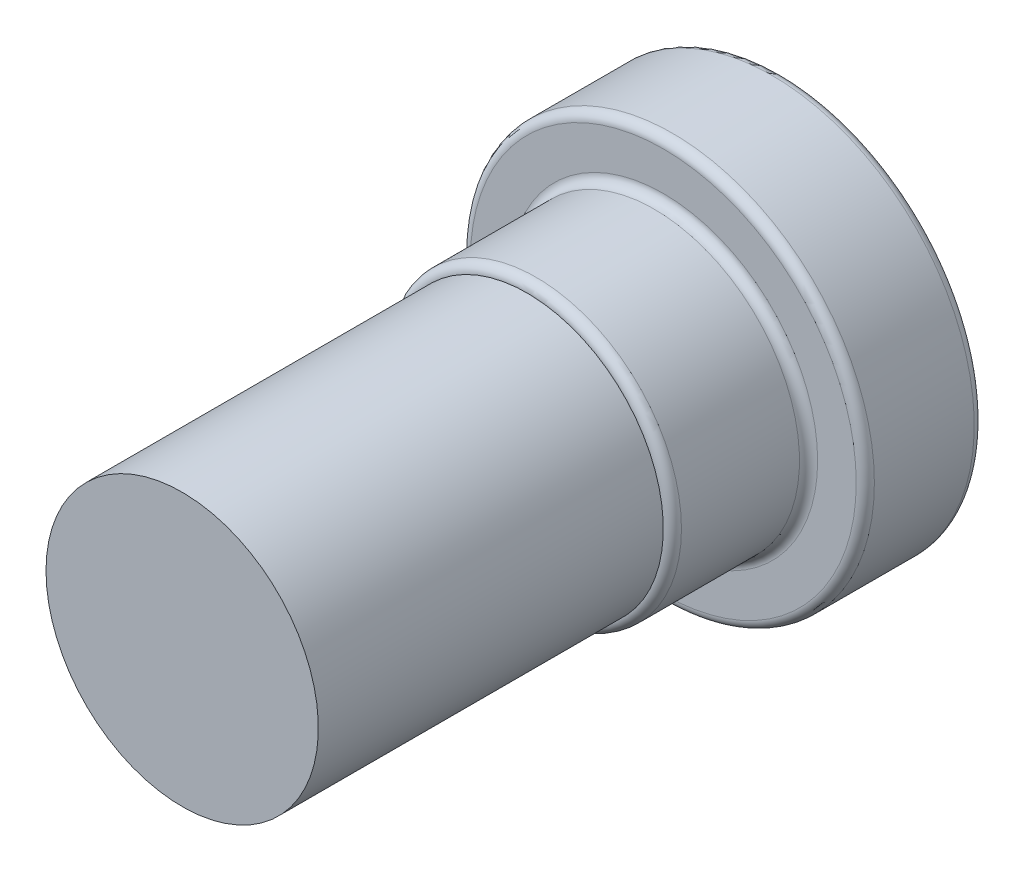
ISO-10303-21;
HEADER;
FILE_DESCRIPTION(('STEP AP214'),'2;1');
FILE_NAME('part.step','',(''),(''),'','','');
FILE_SCHEMA(('AUTOMOTIVE_DESIGN { 1 0 10303 214 1 1 1 1 }'));
ENDSEC;
DATA;
#1=APPLICATION_CONTEXT('core data for automotive mechanical design processes');
#2=APPLICATION_PROTOCOL_DEFINITION('international standard','automotive_design',2000,#1);
#3=PRODUCT_CONTEXT('',#1,'mechanical');
#4=PRODUCT('Part','Part','',(#3));
#5=PRODUCT_RELATED_PRODUCT_CATEGORY('part','',(#4));
#6=PRODUCT_DEFINITION_FORMATION('','',#4);
#7=PRODUCT_DEFINITION_CONTEXT('part definition',#1,'design');
#8=PRODUCT_DEFINITION('design','',#6,#7);
#9=PRODUCT_DEFINITION_SHAPE('','',#8);
#10=(LENGTH_UNIT() NAMED_UNIT(*) SI_UNIT(.MILLI.,.METRE.));
#11=(NAMED_UNIT(*) PLANE_ANGLE_UNIT() SI_UNIT($,.RADIAN.));
#12=(NAMED_UNIT(*) SI_UNIT($,.STERADIAN.) SOLID_ANGLE_UNIT());
#13=UNCERTAINTY_MEASURE_WITH_UNIT(LENGTH_MEASURE(1.E-05),#10,'distance_accuracy_value','');
#14=(GEOMETRIC_REPRESENTATION_CONTEXT(3) GLOBAL_UNCERTAINTY_ASSIGNED_CONTEXT((#13)) GLOBAL_UNIT_ASSIGNED_CONTEXT((#10,
#11,#12)) REPRESENTATION_CONTEXT('',''));
#15=CARTESIAN_POINT('',(0.,0.,0.));
#16=DIRECTION('',(0.,0.,1.));
#17=DIRECTION('',(1.,0.,0.));
#18=AXIS2_PLACEMENT_3D('',#15,#16,#17);
#19=CARTESIAN_POINT('',(0.,0.,1.5));
#20=DIRECTION('',(0.,0.,-1.));
#21=DIRECTION('',(-1.,0.,0.));
#22=AXIS2_PLACEMENT_3D('',#19,#20,#21);
#23=PLANE('',#22);
#24=DIRECTION('',(0.866025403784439,-0.5,0.));
#25=VECTOR('',#24,1.);
#26=CARTESIAN_POINT('',(0.,-1.15470053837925,1.5));
#27=LINE('',#26,#25);
#28=CARTESIAN_POINT('',(0.,-1.15470053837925,1.5));
#29=VERTEX_POINT('',#28);
#30=CARTESIAN_POINT('',(-1.,-0.577350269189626,1.5));
#31=VERTEX_POINT('',#30);
#32=EDGE_CURVE('E110',#29,#31,#27,.F.);
#33=ORIENTED_EDGE('',*,*,#32,.T.);
#34=DIRECTION('',(0.,-1.,0.));
#35=VECTOR('',#34,1.);
#36=CARTESIAN_POINT('',(-1.,-0.577350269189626,1.5));
#37=LINE('',#36,#35);
#38=CARTESIAN_POINT('',(-0.999999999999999,0.577350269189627,1.5));
#39=VERTEX_POINT('',#38);
#40=EDGE_CURVE('E430',#31,#39,#37,.F.);
#41=ORIENTED_EDGE('',*,*,#40,.T.);
#42=DIRECTION('',(-0.866025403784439,-0.5,0.));
#43=VECTOR('',#42,1.);
#44=CARTESIAN_POINT('',(-0.999999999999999,0.577350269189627,1.5));
#45=LINE('',#44,#43);
#46=CARTESIAN_POINT('',(0.,1.15470053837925,1.5));
#47=VERTEX_POINT('',#46);
#48=EDGE_CURVE('E437',#39,#47,#45,.F.);
#49=ORIENTED_EDGE('',*,*,#48,.T.);
#50=DIRECTION('',(-0.866025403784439,0.5,0.));
#51=VECTOR('',#50,1.);
#52=CARTESIAN_POINT('',(0.,1.15470053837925,1.5));
#53=LINE('',#52,#51);
#54=CARTESIAN_POINT('',(1.,0.577350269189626,1.5));
#55=VERTEX_POINT('',#54);
#56=EDGE_CURVE('E93',#47,#55,#53,.F.);
#57=ORIENTED_EDGE('',*,*,#56,.T.);
#58=DIRECTION('',(0.,1.,0.));
#59=VECTOR('',#58,1.);
#60=CARTESIAN_POINT('',(1.,0.577350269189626,1.5));
#61=LINE('',#60,#59);
#62=CARTESIAN_POINT('',(1.,-0.577350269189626,1.5));
#63=VERTEX_POINT('',#62);
#64=EDGE_CURVE('E90',#55,#63,#61,.F.);
#65=ORIENTED_EDGE('',*,*,#64,.T.);
#66=DIRECTION('',(0.866025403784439,0.5,0.));
#67=VECTOR('',#66,1.);
#68=CARTESIAN_POINT('',(1.,-0.577350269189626,1.5));
#69=LINE('',#68,#67);
#70=EDGE_CURVE('E87',#63,#29,#69,.F.);
#71=ORIENTED_EDGE('',*,*,#70,.T.);
#72=EDGE_LOOP('',(#33,#41,#49,#57,#65,#71));
#73=FACE_BOUND('',#72,.T.);
#74=ADVANCED_FACE('F17',(#73),#23,.T.);
#75=CARTESIAN_POINT('',(1.,0.577350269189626,1.5));
#76=DIRECTION('',(1.,0.,0.));
#77=DIRECTION('',(0.,1.,0.));
#78=AXIS2_PLACEMENT_3D('',#75,#76,#77);
#79=PLANE('',#78);
#80=DIRECTION('',(0.,0.,1.));
#81=VECTOR('',#80,1.);
#82=CARTESIAN_POINT('',(1.,-0.577350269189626,1.5));
#83=LINE('',#82,#81);
#84=CARTESIAN_POINT('',(1.,-0.577350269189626,0.));
#85=VERTEX_POINT('',#84);
#86=EDGE_CURVE('E96',#85,#63,#83,.T.);
#87=ORIENTED_EDGE('',*,*,#86,.T.);
#88=ORIENTED_EDGE('',*,*,#64,.F.);
#89=DIRECTION('',(0.,0.,1.));
#90=VECTOR('',#89,1.);
#91=CARTESIAN_POINT('',(1.,0.577350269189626,1.5));
#92=LINE('',#91,#90);
#93=CARTESIAN_POINT('',(1.,0.577350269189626,0.));
#94=VERTEX_POINT('',#93);
#95=EDGE_CURVE('E445',#55,#94,#92,.F.);
#96=ORIENTED_EDGE('',*,*,#95,.T.);
#97=DIRECTION('',(0.,1.,0.));
#98=VECTOR('',#97,1.);
#99=CARTESIAN_POINT('',(1.,0.,0.));
#100=LINE('',#99,#98);
#101=EDGE_CURVE('E101',#94,#85,#100,.F.);
#102=ORIENTED_EDGE('',*,*,#101,.T.);
#103=EDGE_LOOP('',(#87,#88,#96,#102));
#104=FACE_BOUND('',#103,.T.);
#105=ADVANCED_FACE('F99',(#104),#79,.F.);
#106=CARTESIAN_POINT('',(1.,-0.577350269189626,1.5));
#107=DIRECTION('',(0.5,-0.866025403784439,0.));
#108=DIRECTION('',(0.866025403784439,0.5,0.));
#109=AXIS2_PLACEMENT_3D('',#106,#107,#108);
#110=PLANE('',#109);
#111=DIRECTION('',(0.,0.,1.));
#112=VECTOR('',#111,1.);
#113=CARTESIAN_POINT('',(0.,-1.15470053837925,1.5));
#114=LINE('',#113,#112);
#115=CARTESIAN_POINT('',(0.,-1.15470053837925,0.));
#116=VERTEX_POINT('',#115);
#117=EDGE_CURVE('E107',#116,#29,#114,.T.);
#118=ORIENTED_EDGE('',*,*,#117,.T.);
#119=ORIENTED_EDGE('',*,*,#70,.F.);
#120=ORIENTED_EDGE('',*,*,#86,.F.);
#121=DIRECTION('',(-0.866025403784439,-0.5,0.));
#122=VECTOR('',#121,1.);
#123=CARTESIAN_POINT('',(1.,-0.577350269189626,0.));
#124=LINE('',#123,#122);
#125=EDGE_CURVE('E456',#85,#116,#124,.T.);
#126=ORIENTED_EDGE('',*,*,#125,.T.);
#127=EDGE_LOOP('',(#118,#119,#120,#126));
#128=FACE_BOUND('',#127,.T.);
#129=ADVANCED_FACE('F105',(#128),#110,.F.);
#130=CARTESIAN_POINT('',(0.,-1.15470053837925,1.5));
#131=DIRECTION('',(-0.5,-0.866025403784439,0.));
#132=DIRECTION('',(0.866025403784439,-0.5,0.));
#133=AXIS2_PLACEMENT_3D('',#130,#131,#132);
#134=PLANE('',#133);
#135=DIRECTION('',(0.,0.,1.));
#136=VECTOR('',#135,1.);
#137=CARTESIAN_POINT('',(-1.,-0.577350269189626,1.5));
#138=LINE('',#137,#136);
#139=CARTESIAN_POINT('',(-1.,-0.577350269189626,0.));
#140=VERTEX_POINT('',#139);
#141=EDGE_CURVE('E425',#140,#31,#138,.T.);
#142=ORIENTED_EDGE('',*,*,#141,.T.);
#143=ORIENTED_EDGE('',*,*,#32,.F.);
#144=ORIENTED_EDGE('',*,*,#117,.F.);
#145=DIRECTION('',(-0.866025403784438,0.5,0.));
#146=VECTOR('',#145,1.);
#147=CARTESIAN_POINT('',(0.,-1.15470053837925,0.));
#148=LINE('',#147,#146);
#149=EDGE_CURVE('E428',#116,#140,#148,.T.);
#150=ORIENTED_EDGE('',*,*,#149,.T.);
#151=EDGE_LOOP('',(#142,#143,#144,#150));
#152=FACE_BOUND('',#151,.T.);
#153=ADVANCED_FACE('F263',(#152),#134,.F.);
#154=CARTESIAN_POINT('',(-1.,-0.577350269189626,1.5));
#155=DIRECTION('',(-1.,0.,0.));
#156=DIRECTION('',(0.,-1.,0.));
#157=AXIS2_PLACEMENT_3D('',#154,#155,#156);
#158=PLANE('',#157);
#159=DIRECTION('',(0.,0.,1.));
#160=VECTOR('',#159,1.);
#161=CARTESIAN_POINT('',(-0.999999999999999,0.577350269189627,1.5));
#162=LINE('',#161,#160);
#163=CARTESIAN_POINT('',(-0.999999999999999,0.577350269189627,0.));
#164=VERTEX_POINT('',#163);
#165=EDGE_CURVE('E434',#164,#39,#162,.T.);
#166=ORIENTED_EDGE('',*,*,#165,.T.);
#167=ORIENTED_EDGE('',*,*,#40,.F.);
#168=ORIENTED_EDGE('',*,*,#141,.F.);
#169=DIRECTION('',(0.,1.,0.));
#170=VECTOR('',#169,1.);
#171=CARTESIAN_POINT('',(-1.,0.,0.));
#172=LINE('',#171,#170);
#173=EDGE_CURVE('E459',#140,#164,#172,.T.);
#174=ORIENTED_EDGE('',*,*,#173,.T.);
#175=EDGE_LOOP('',(#166,#167,#168,#174));
#176=FACE_BOUND('',#175,.T.);
#177=ADVANCED_FACE('F259',(#176),#158,.F.);
#178=CARTESIAN_POINT('',(-0.999999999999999,0.577350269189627,1.5));
#179=DIRECTION('',(-0.5,0.866025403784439,0.));
#180=DIRECTION('',(-0.866025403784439,-0.5,0.));
#181=AXIS2_PLACEMENT_3D('',#178,#179,#180);
#182=PLANE('',#181);
#183=DIRECTION('',(0.,0.,1.));
#184=VECTOR('',#183,1.);
#185=CARTESIAN_POINT('',(0.,1.15470053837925,1.5));
#186=LINE('',#185,#184);
#187=CARTESIAN_POINT('',(0.,1.15470053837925,0.));
#188=VERTEX_POINT('',#187);
#189=EDGE_CURVE('E441',#188,#47,#186,.T.);
#190=ORIENTED_EDGE('',*,*,#189,.T.);
#191=ORIENTED_EDGE('',*,*,#48,.F.);
#192=ORIENTED_EDGE('',*,*,#165,.F.);
#193=DIRECTION('',(0.866025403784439,0.5,0.));
#194=VECTOR('',#193,1.);
#195=CARTESIAN_POINT('',(-0.999999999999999,0.577350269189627,0.));
#196=LINE('',#195,#194);
#197=EDGE_CURVE('E460',#164,#188,#196,.T.);
#198=ORIENTED_EDGE('',*,*,#197,.T.);
#199=EDGE_LOOP('',(#190,#191,#192,#198));
#200=FACE_BOUND('',#199,.T.);
#201=ADVANCED_FACE('F255',(#200),#182,.F.);
#202=CARTESIAN_POINT('',(0.,1.15470053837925,1.5));
#203=DIRECTION('',(0.5,0.866025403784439,0.));
#204=DIRECTION('',(-0.866025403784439,0.5,0.));
#205=AXIS2_PLACEMENT_3D('',#202,#203,#204);
#206=PLANE('',#205);
#207=ORIENTED_EDGE('',*,*,#95,.F.);
#208=ORIENTED_EDGE('',*,*,#56,.F.);
#209=ORIENTED_EDGE('',*,*,#189,.F.);
#210=DIRECTION('',(0.866025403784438,-0.5,0.));
#211=VECTOR('',#210,1.);
#212=CARTESIAN_POINT('',(0.,1.15470053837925,0.));
#213=LINE('',#212,#211);
#214=EDGE_CURVE('E227',#188,#94,#213,.T.);
#215=ORIENTED_EDGE('',*,*,#214,.T.);
#216=EDGE_LOOP('',(#207,#208,#209,#215));
#217=FACE_BOUND('',#216,.T.);
#218=ADVANCED_FACE('F249',(#217),#206,.F.);
#219=CARTESIAN_POINT('',(0.,0.,0.));
#220=DIRECTION('',(0.,0.,1.));
#221=DIRECTION('',(1.,0.,0.));
#222=AXIS2_PLACEMENT_3D('',#219,#220,#221);
#223=PLANE('',#222);
#224=CARTESIAN_POINT('',(0.,0.,0.));
#225=DIRECTION('',(0.,0.,1.));
#226=DIRECTION('',(1.,0.,0.));
#227=AXIS2_PLACEMENT_3D('',#224,#225,#226);
#228=CIRCLE('',#227,2.125);
#229=CARTESIAN_POINT('',(2.125,0.,0.));
#230=VERTEX_POINT('',#229);
#231=CARTESIAN_POINT('',(-2.125,0.,0.));
#232=VERTEX_POINT('',#231);
#233=EDGE_CURVE('E219',#230,#232,#228,.T.);
#234=ORIENTED_EDGE('',*,*,#233,.F.);
#235=CARTESIAN_POINT('',(0.,0.,0.));
#236=DIRECTION('',(0.,0.,1.));
#237=DIRECTION('',(-1.,0.,0.));
#238=AXIS2_PLACEMENT_3D('',#235,#236,#237);
#239=CIRCLE('',#238,2.125);
#240=EDGE_CURVE('E223',#232,#230,#239,.T.);
#241=ORIENTED_EDGE('',*,*,#240,.F.);
#242=EDGE_LOOP('',(#234,#241));
#243=FACE_BOUND('',#242,.T.);
#244=ORIENTED_EDGE('',*,*,#197,.F.);
#245=ORIENTED_EDGE('',*,*,#173,.F.);
#246=ORIENTED_EDGE('',*,*,#149,.F.);
#247=ORIENTED_EDGE('',*,*,#125,.F.);
#248=ORIENTED_EDGE('',*,*,#101,.F.);
#249=ORIENTED_EDGE('',*,*,#214,.F.);
#250=EDGE_LOOP('',(#244,#245,#246,#247,#248,#249));
#251=FACE_BOUND('',#250,.T.);
#252=ADVANCED_FACE('F229',(#243,#251),#223,.F.);
#253=CARTESIAN_POINT('',(0.,0.,0.1));
#254=DIRECTION('',(0.,0.,1.));
#255=DIRECTION('',(1.,0.,0.));
#256=AXIS2_PLACEMENT_3D('',#253,#254,#255);
#257=TOROIDAL_SURFACE('',#256,2.125,0.1);
#258=ORIENTED_EDGE('',*,*,#233,.T.);
#259=ORIENTED_EDGE('',*,*,#240,.T.);
#260=EDGE_LOOP('',(#258,#259));
#261=FACE_BOUND('',#260,.T.);
#262=CARTESIAN_POINT('',(0.,0.,0.1));
#263=DIRECTION('',(0.,0.,-1.));
#264=DIRECTION('',(-1.,0.,0.));
#265=AXIS2_PLACEMENT_3D('',#262,#263,#264);
#266=CIRCLE('',#265,2.225);
#267=CARTESIAN_POINT('',(-2.225,0.,0.1));
#268=VERTEX_POINT('',#267);
#269=EDGE_CURVE('E231',#268,#268,#266,.F.);
#270=ORIENTED_EDGE('',*,*,#269,.F.);
#271=EDGE_LOOP('',(#270));
#272=FACE_BOUND('',#271,.T.);
#273=ADVANCED_FACE('F221',(#261,#272),#257,.T.);
#274=CARTESIAN_POINT('',(0.,0.,1.3));
#275=DIRECTION('',(0.,0.,-1.));
#276=DIRECTION('',(-1.,0.,0.));
#277=AXIS2_PLACEMENT_3D('',#274,#275,#276);
#278=CYLINDRICAL_SURFACE('',#277,2.225);
#279=CARTESIAN_POINT('',(0.,0.,1.2));
#280=DIRECTION('',(0.,0.,1.));
#281=DIRECTION('',(1.,0.,0.));
#282=AXIS2_PLACEMENT_3D('',#279,#280,#281);
#283=CIRCLE('',#282,2.225);
#284=CARTESIAN_POINT('',(2.225,0.,1.2));
#285=VERTEX_POINT('',#284);
#286=EDGE_CURVE('E294',#285,#285,#283,.T.);
#287=ORIENTED_EDGE('',*,*,#286,.F.);
#288=EDGE_LOOP('',(#287));
#289=FACE_BOUND('',#288,.T.);
#290=ORIENTED_EDGE('',*,*,#269,.T.);
#291=EDGE_LOOP('',(#290));
#292=FACE_BOUND('',#291,.T.);
#293=ADVANCED_FACE('F204',(#289,#292),#278,.T.);
#294=CARTESIAN_POINT('',(0.,0.,1.2));
#295=DIRECTION('',(0.,0.,1.));
#296=DIRECTION('',(1.,0.,0.));
#297=AXIS2_PLACEMENT_3D('',#294,#295,#296);
#298=TOROIDAL_SURFACE('',#297,2.125,0.1);
#299=ORIENTED_EDGE('',*,*,#286,.T.);
#300=EDGE_LOOP('',(#299));
#301=FACE_BOUND('',#300,.T.);
#302=CARTESIAN_POINT('',(0.,0.,1.3));
#303=DIRECTION('',(0.,0.,-1.));
#304=DIRECTION('',(1.,0.,0.));
#305=AXIS2_PLACEMENT_3D('',#302,#303,#304);
#306=CIRCLE('',#305,2.125);
#307=CARTESIAN_POINT('',(-2.125,0.,1.3));
#308=VERTEX_POINT('',#307);
#309=CARTESIAN_POINT('',(2.125,0.,1.3));
#310=VERTEX_POINT('',#309);
#311=EDGE_CURVE('E180',#308,#310,#306,.F.);
#312=ORIENTED_EDGE('',*,*,#311,.F.);
#313=CARTESIAN_POINT('',(0.,0.,1.3));
#314=DIRECTION('',(0.,0.,-1.));
#315=DIRECTION('',(-1.,0.,0.));
#316=AXIS2_PLACEMENT_3D('',#313,#314,#315);
#317=CIRCLE('',#316,2.125);
#318=EDGE_CURVE('E170',#310,#308,#317,.F.);
#319=ORIENTED_EDGE('',*,*,#318,.F.);
#320=EDGE_LOOP('',(#312,#319));
#321=FACE_BOUND('',#320,.T.);
#322=ADVANCED_FACE('F200',(#301,#321),#298,.T.);
#323=CARTESIAN_POINT('',(0.,0.,1.3));
#324=DIRECTION('',(0.,0.,1.));
#325=DIRECTION('',(1.,0.,0.));
#326=AXIS2_PLACEMENT_3D('',#323,#324,#325);
#327=PLANE('',#326);
#328=ORIENTED_EDGE('',*,*,#318,.T.);
#329=ORIENTED_EDGE('',*,*,#311,.T.);
#330=EDGE_LOOP('',(#328,#329));
#331=FACE_BOUND('',#330,.T.);
#332=CARTESIAN_POINT('',(0.,0.,1.3));
#333=DIRECTION('',(0.,0.,1.));
#334=DIRECTION('',(-1.,0.,0.));
#335=AXIS2_PLACEMENT_3D('',#332,#333,#334);
#336=CIRCLE('',#335,1.7);
#337=CARTESIAN_POINT('',(1.7,0.,1.3));
#338=VERTEX_POINT('',#337);
#339=CARTESIAN_POINT('',(-1.7,0.,1.3));
#340=VERTEX_POINT('',#339);
#341=EDGE_CURVE('E119',#338,#340,#336,.F.);
#342=ORIENTED_EDGE('',*,*,#341,.T.);
#343=CARTESIAN_POINT('',(0.,0.,1.3));
#344=DIRECTION('',(0.,0.,1.));
#345=DIRECTION('',(1.,0.,0.));
#346=AXIS2_PLACEMENT_3D('',#343,#344,#345);
#347=CIRCLE('',#346,1.7);
#348=EDGE_CURVE('E36',#340,#338,#347,.F.);
#349=ORIENTED_EDGE('',*,*,#348,.T.);
#350=EDGE_LOOP('',(#342,#349));
#351=FACE_BOUND('',#350,.T.);
#352=ADVANCED_FACE('F137',(#331,#351),#327,.T.);
#353=CARTESIAN_POINT('',(0.,0.,1.4));
#354=DIRECTION('',(0.,0.,1.));
#355=DIRECTION('',(1.,0.,0.));
#356=AXIS2_PLACEMENT_3D('',#353,#354,#355);
#357=TOROIDAL_SURFACE('',#356,1.7,0.1);
#358=CARTESIAN_POINT('',(0.,0.,1.4));
#359=DIRECTION('',(0.,0.,-1.));
#360=DIRECTION('',(-1.,0.,0.));
#361=AXIS2_PLACEMENT_3D('',#358,#359,#360);
#362=CIRCLE('',#361,1.6);
#363=CARTESIAN_POINT('',(-1.6,0.,1.4));
#364=VERTEX_POINT('',#363);
#365=EDGE_CURVE('E147',#364,#364,#362,.F.);
#366=ORIENTED_EDGE('',*,*,#365,.F.);
#367=EDGE_LOOP('',(#366));
#368=FACE_BOUND('',#367,.T.);
#369=ORIENTED_EDGE('',*,*,#341,.F.);
#370=ORIENTED_EDGE('',*,*,#348,.F.);
#371=EDGE_LOOP('',(#369,#370));
#372=FACE_BOUND('',#371,.T.);
#373=ADVANCED_FACE('F125',(#368,#372),#357,.F.);
#374=CARTESIAN_POINT('',(0.,0.,2.8));
#375=DIRECTION('',(0.,0.,-1.));
#376=DIRECTION('',(-1.,0.,0.));
#377=AXIS2_PLACEMENT_3D('',#374,#375,#376);
#378=CYLINDRICAL_SURFACE('',#377,1.6);
#379=ORIENTED_EDGE('',*,*,#365,.T.);
#380=EDGE_LOOP('',(#379));
#381=FACE_BOUND('',#380,.T.);
#382=CARTESIAN_POINT('',(0.,0.,2.7));
#383=DIRECTION('',(0.,0.,1.));
#384=DIRECTION('',(1.,0.,0.));
#385=AXIS2_PLACEMENT_3D('',#382,#383,#384);
#386=CIRCLE('',#385,1.6);
#387=CARTESIAN_POINT('',(1.6,0.,2.7));
#388=VERTEX_POINT('',#387);
#389=EDGE_CURVE('E116',#388,#388,#386,.T.);
#390=ORIENTED_EDGE('',*,*,#389,.F.);
#391=EDGE_LOOP('',(#390));
#392=FACE_BOUND('',#391,.T.);
#393=ADVANCED_FACE('F136',(#381,#392),#378,.T.);
#394=CARTESIAN_POINT('',(0.,0.,6.6));
#395=DIRECTION('',(0.,0.,1.));
#396=DIRECTION('',(1.,0.,0.));
#397=AXIS2_PLACEMENT_3D('',#394,#395,#396);
#398=PLANE('',#397);
#399=CARTESIAN_POINT('',(0.,0.,6.6));
#400=DIRECTION('',(0.,0.,-1.));
#401=DIRECTION('',(-1.,0.,0.));
#402=AXIS2_PLACEMENT_3D('',#399,#400,#401);
#403=CIRCLE('',#402,1.5);
#404=CARTESIAN_POINT('',(-1.5,0.,6.6));
#405=VERTEX_POINT('',#404);
#406=EDGE_CURVE('E28',#405,#405,#403,.T.);
#407=ORIENTED_EDGE('',*,*,#406,.F.);
#408=EDGE_LOOP('',(#407));
#409=FACE_BOUND('',#408,.T.);
#410=ADVANCED_FACE('F282',(#409),#398,.T.);
#411=CARTESIAN_POINT('',(0.,0.,2.7));
#412=DIRECTION('',(0.,0.,1.));
#413=DIRECTION('',(1.,0.,0.));
#414=AXIS2_PLACEMENT_3D('',#411,#412,#413);
#415=TOROIDAL_SURFACE('',#414,1.5,0.1);
#416=CARTESIAN_POINT('',(0.,0.,2.8));
#417=DIRECTION('',(0.,0.,-1.));
#418=DIRECTION('',(-1.,0.,0.));
#419=AXIS2_PLACEMENT_3D('',#416,#417,#418);
#420=CIRCLE('',#419,1.5);
#421=CARTESIAN_POINT('',(-1.5,0.,2.8));
#422=VERTEX_POINT('',#421);
#423=EDGE_CURVE('E11',#422,#422,#420,.F.);
#424=ORIENTED_EDGE('',*,*,#423,.F.);
#425=EDGE_LOOP('',(#424));
#426=FACE_BOUND('',#425,.T.);
#427=ORIENTED_EDGE('',*,*,#389,.T.);
#428=EDGE_LOOP('',(#427));
#429=FACE_BOUND('',#428,.T.);
#430=ADVANCED_FACE('F276',(#426,#429),#415,.T.);
#431=CARTESIAN_POINT('',(0.,0.,6.6));
#432=DIRECTION('',(0.,0.,-1.));
#433=DIRECTION('',(-1.,0.,0.));
#434=AXIS2_PLACEMENT_3D('',#431,#432,#433);
#435=CYLINDRICAL_SURFACE('',#434,1.5);
#436=ORIENTED_EDGE('',*,*,#423,.T.);
#437=EDGE_LOOP('',(#436));
#438=FACE_BOUND('',#437,.T.);
#439=ORIENTED_EDGE('',*,*,#406,.T.);
#440=EDGE_LOOP('',(#439));
#441=FACE_BOUND('',#440,.T.);
#442=ADVANCED_FACE('F274',(#438,#441),#435,.T.);
#443=CLOSED_SHELL('',(#74,#105,#129,#153,#177,#201,#218,#252,#273,#293,#322,#352,#373,#393,#410,
#430,#442));
#444=MANIFOLD_SOLID_BREP('B1',#443);
#445=ADVANCED_BREP_SHAPE_REPRESENTATION('',(#18,#444),#14);
#446=SHAPE_DEFINITION_REPRESENTATION(#9,#445);
ENDSEC;
END-ISO-10303-21;
